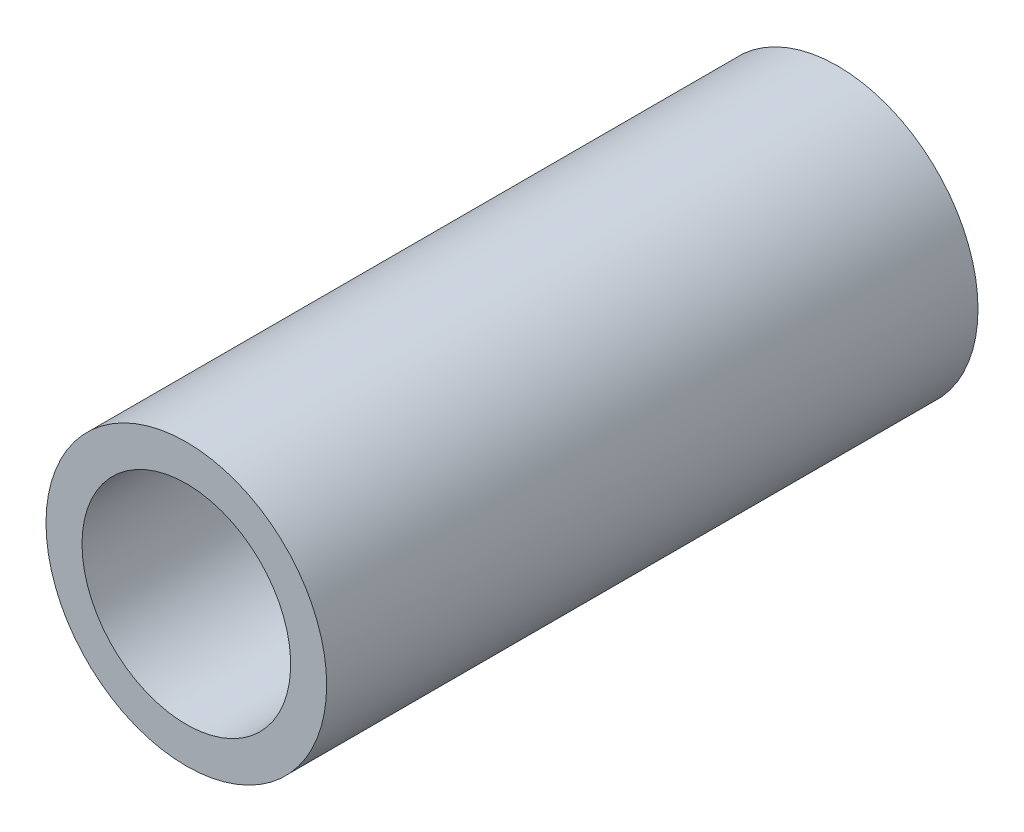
from build123d import *

# Parameters (mm, degrees)
SKETCH1_R           = 6.731
SKETCH1_R_2         = 5.0038
BOSS_EXTRUDE1_DEPTH = 31.242


with BuildPart() as part:
    # Sketch1 → Boss-Extrude1 (new body)
    with BuildSketch(Plane.XY):
        with Locations(Location((0, 0, 0), (0, 0, 180))):
            Circle(SKETCH1_R)
        with Locations(Location((0, 0, 0), (0, 0, 180))):
            Circle(SKETCH1_R_2, mode=Mode.SUBTRACT)
    extrude(amount=BOSS_EXTRUDE1_DEPTH)


solid = part.part
